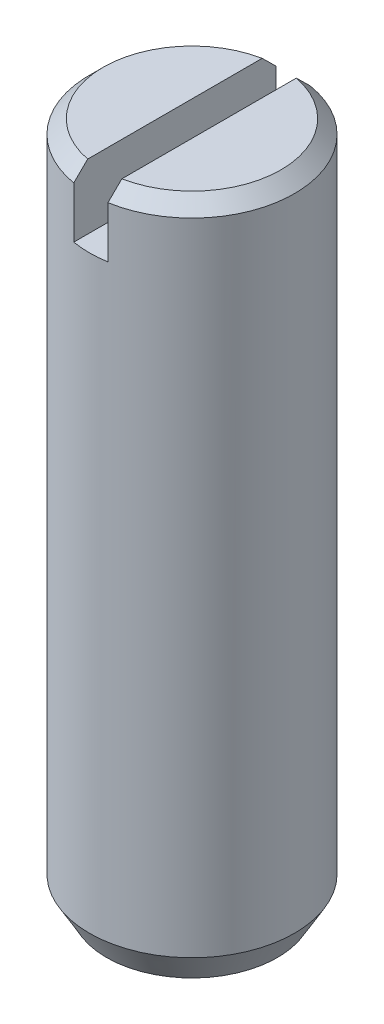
from build123d import *

# Parameters (mm, degrees)
SKETCH_10_R         = 1.5
EXTRUDE_1_DEPTH     = 10
SKETCH_12_W         = 0.5
SKETCH_12_H         = 3.174459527
CUT_EXTRUDE_5_DEPTH = 0.9503947
CHAMFER_2_SIZE      = 0.2
CHAMFER_3_SIZE      = 0.25
CHAMFER_3_SIZE2     = 0.433012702


with BuildPart() as part:
    # Sketch 10 → Extrude 1 (new body)
    with BuildSketch(Plane(origin=(0, 0, 0), x_dir=(1, 0, 0), z_dir=(0, 1, 0))):
        with Locations(Location((0, 0, 0), (0, 0, 270))):
            Circle(SKETCH_10_R)
    extrude(amount=EXTRUDE_1_DEPTH)

    # Sketch 12 → Cut-Extrude 5 (cut)
    with BuildSketch(Plane(origin=(0, 10, 0), x_dir=(-1, 0, 0), z_dir=(0, 1, 0))):
        with Locations((0, 0.049773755)):
            Rectangle(SKETCH_12_W, SKETCH_12_H)
    extrude(amount=-CUT_EXTRUDE_5_DEPTH, mode=Mode.SUBTRACT)

    # Chamfer 2
    chamfer_2_edges = [part.edges().sort_by_distance(p)[0] for p in [
        (1.5, 10, 0),
        (-1.5, 10, 0),
    ]]
    chamfer(chamfer_2_edges, length=CHAMFER_2_SIZE)

    # Chamfer 3
    chamfer_3_edges = [part.edges().sort_by_distance(p)[0] for p in [
        (0, 0, -1.5),
    ]]
    chamfer_3_side = [part.faces().sort_by_distance(p)[0] for p in [
        (0, 0, 0),
    ]]
    chamfer(chamfer_3_edges, length=CHAMFER_3_SIZE, length2=CHAMFER_3_SIZE2, reference=chamfer_3_side[0])


solid = part.part
